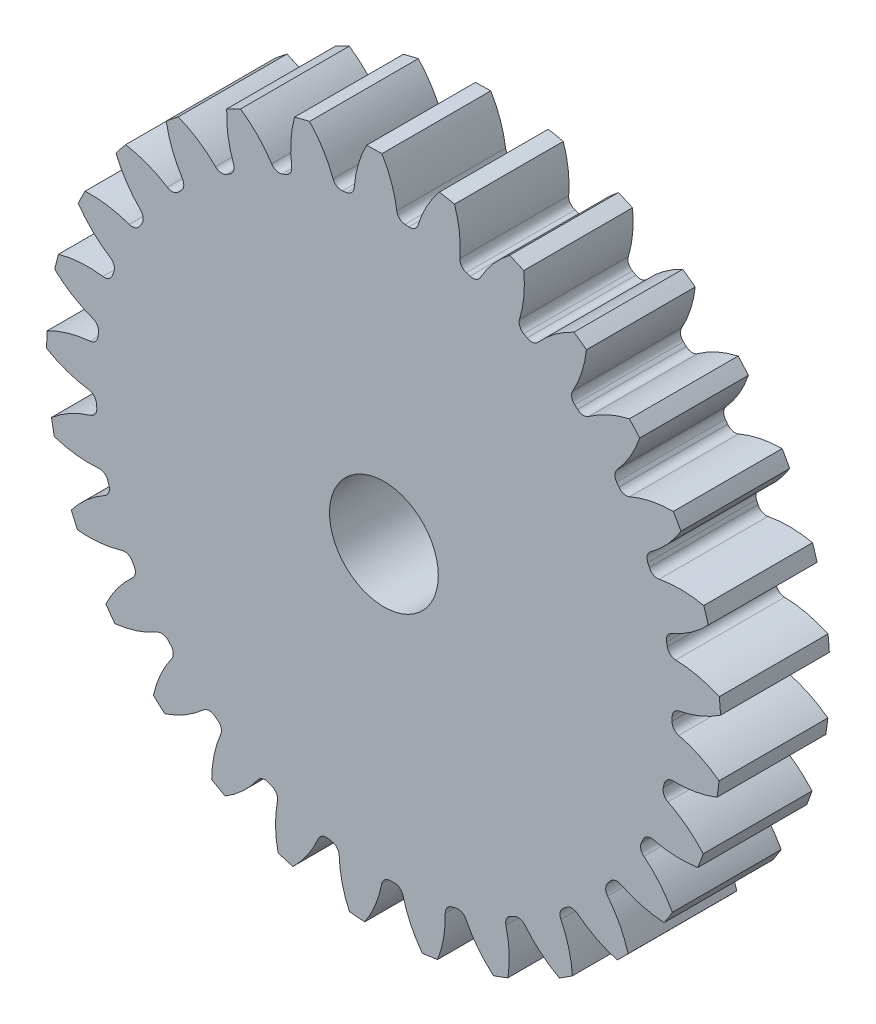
from build123d import *

# Parameters (mm, degrees)
SKETCH3_R         = 314.96
GEARBODY_DEPTH    = 101.6
TOOTHCUT_DEPTH    = 457.861207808
CIRPATTERN1_COUNT = 29
BOREDIA_R         = 50.8
BORE_DEPTH        = 12700


with BuildPart() as part:
    # Sketch3 → gearBody (new body)
    with BuildSketch(Plane.XY):
        Circle(SKETCH3_R)
    extrude(amount=GEARBODY_DEPTH)

    # Sketch2 → toothCut (cut, through all)
    with BuildSketch(Plane.XY):
        with BuildLine():
            ThreePointArc((269.099104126, -8.70917669), (269.152063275, -6.880729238), (269.192598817, -5.051964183))
            ThreePointArc((269.192598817, -5.051964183), (271.128153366, 0.11141418), (275.879239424, 2.910347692))
            ThreePointArc((275.879239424, 2.910347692), (296.251158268, 9.079393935), (314.96, 19.230819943))
            ThreePointArc((314.96, 19.230819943), (315.443490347, -8.064144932), (313.565980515, -35.298752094))
            ThreePointArc((313.565980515, -35.298752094), (295.400269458, -24.204647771), (275.370171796, -17.00274548))
            ThreePointArc((275.370171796, -17.00274548), (270.768304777, -13.964708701), (269.099104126, -8.70917669))
        make_face()
    toothcut = extrude(amount=TOOTHCUT_DEPTH, mode=Mode.SUBTRACT)

    # CirPattern1: toothCut ×29 about axis
    cirpattern1_axis = Axis((0, 0, 0), (0, 0, 1))
    for i in range(1, CIRPATTERN1_COUNT):
        add(toothcut.rotate(cirpattern1_axis, i * 360 / CIRPATTERN1_COUNT), mode=Mode.SUBTRACT)

    # boreDia → bore (cut, symmetric)
    with BuildSketch(Plane.XY):
        Circle(BOREDIA_R)
    extrude(amount=BORE_DEPTH, both=True, mode=Mode.SUBTRACT)


solid = part.part
